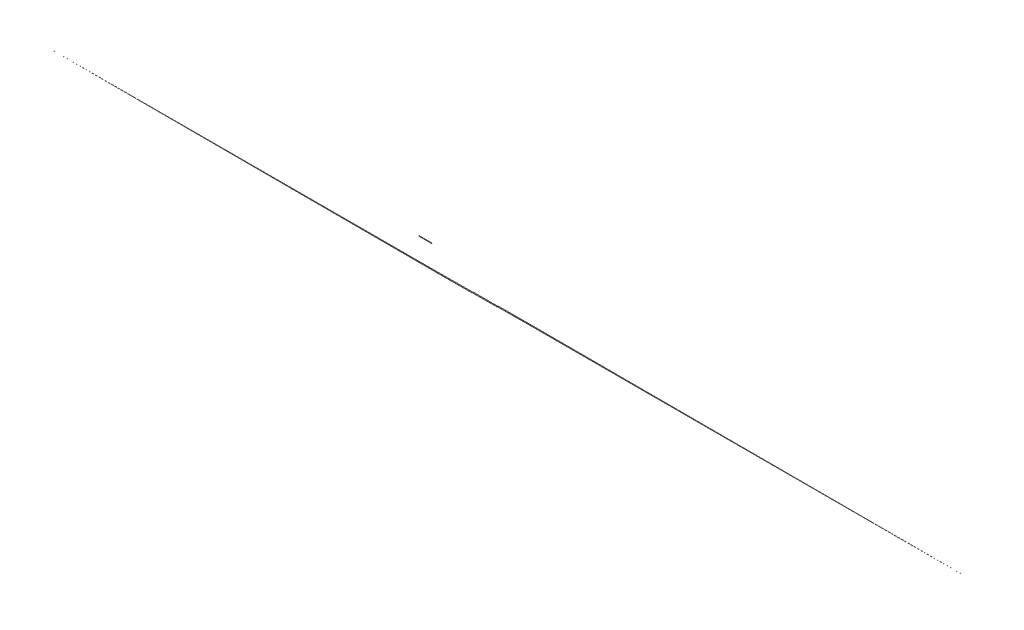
ISO-10303-21;
HEADER;
FILE_DESCRIPTION(('STEP AP214'),'2;1');
FILE_NAME('part.step','',(''),(''),'','','');
FILE_SCHEMA(('AUTOMOTIVE_DESIGN { 1 0 10303 214 1 1 1 1 }'));
ENDSEC;
DATA;
#1=APPLICATION_CONTEXT('core data for automotive mechanical design processes');
#2=APPLICATION_PROTOCOL_DEFINITION('international standard','automotive_design',2000,#1);
#3=PRODUCT_CONTEXT('',#1,'mechanical');
#4=PRODUCT('Part','Part','',(#3));
#5=PRODUCT_RELATED_PRODUCT_CATEGORY('part','',(#4));
#6=PRODUCT_DEFINITION_FORMATION('','',#4);
#7=PRODUCT_DEFINITION_CONTEXT('part definition',#1,'design');
#8=PRODUCT_DEFINITION('design','',#6,#7);
#9=PRODUCT_DEFINITION_SHAPE('','',#8);
#10=(LENGTH_UNIT() NAMED_UNIT(*) SI_UNIT(.MILLI.,.METRE.));
#11=(NAMED_UNIT(*) PLANE_ANGLE_UNIT() SI_UNIT($,.RADIAN.));
#12=(NAMED_UNIT(*) SI_UNIT($,.STERADIAN.) SOLID_ANGLE_UNIT());
#13=UNCERTAINTY_MEASURE_WITH_UNIT(LENGTH_MEASURE(1.E-05),#10,'distance_accuracy_value','');
#14=(GEOMETRIC_REPRESENTATION_CONTEXT(3) GLOBAL_UNCERTAINTY_ASSIGNED_CONTEXT((#13)) GLOBAL_UNIT_ASSIGNED_CONTEXT((#10,
#11,#12)) REPRESENTATION_CONTEXT('',''));
#15=CARTESIAN_POINT('',(0.,0.,0.));
#16=DIRECTION('',(0.,0.,1.));
#17=DIRECTION('',(1.,0.,0.));
#18=AXIS2_PLACEMENT_3D('',#15,#16,#17);
#19=CARTESIAN_POINT('',(-36752.2624113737,1400.,5.));
#20=DIRECTION('',(1.,0.,0.));
#21=DIRECTION('',(0.,0.,-1.));
#22=AXIS2_PLACEMENT_3D('',#19,#20,#21);
#23=PLANE('',#22);
#24=DIRECTION('',(0.,-1.,0.));
#25=VECTOR('',#24,1.);
#26=CARTESIAN_POINT('',(-36752.2624113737,1400.,-5.));
#27=LINE('',#26,#25);
#28=CARTESIAN_POINT('',(-36752.2624113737,1431.07753214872,-5.));
#29=VERTEX_POINT('',#28);
#30=CARTESIAN_POINT('',(-36752.2624113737,1400.,-5.));
#31=VERTEX_POINT('',#30);
#32=EDGE_CURVE('E110',#29,#31,#27,.T.);
#33=ORIENTED_EDGE('',*,*,#32,.T.);
#34=DIRECTION('',(0.,0.,-1.));
#35=VECTOR('',#34,1.);
#36=CARTESIAN_POINT('',(-36752.2624113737,1400.,5.));
#37=LINE('',#36,#35);
#38=CARTESIAN_POINT('',(-36752.2624113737,1400.,5.));
#39=VERTEX_POINT('',#38);
#40=EDGE_CURVE('E12',#39,#31,#37,.T.);
#41=ORIENTED_EDGE('',*,*,#40,.F.);
#42=DIRECTION('',(0.,-1.,0.));
#43=VECTOR('',#42,1.);
#44=CARTESIAN_POINT('',(-36752.2624113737,1400.,5.));
#45=LINE('',#44,#43);
#46=CARTESIAN_POINT('',(-36752.2624113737,1431.07753214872,5.));
#47=VERTEX_POINT('',#46);
#48=EDGE_CURVE('E98',#47,#39,#45,.T.);
#49=ORIENTED_EDGE('',*,*,#48,.F.);
#50=DIRECTION('',(0.,0.,-1.));
#51=VECTOR('',#50,1.);
#52=CARTESIAN_POINT('',(-36752.2624113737,1431.07753214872,5.));
#53=LINE('',#52,#51);
#54=EDGE_CURVE('E106',#47,#29,#53,.T.);
#55=ORIENTED_EDGE('',*,*,#54,.T.);
#56=EDGE_LOOP('',(#33,#41,#49,#55));
#57=FACE_BOUND('',#56,.T.);
#58=ADVANCED_FACE('F47',(#57),#23,.F.);
#59=CARTESIAN_POINT('',(-36752.2624113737,1400.,5.));
#60=DIRECTION('',(0.,1.,0.));
#61=DIRECTION('',(0.,0.,1.));
#62=AXIS2_PLACEMENT_3D('',#59,#60,#61);
#63=PLANE('',#62);
#64=DIRECTION('',(1.,0.,0.));
#65=VECTOR('',#64,1.);
#66=CARTESIAN_POINT('',(-36752.2624113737,1400.,-5.));
#67=LINE('',#66,#65);
#68=CARTESIAN_POINT('',(-35897.7132387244,1400.,-5.));
#69=VERTEX_POINT('',#68);
#70=EDGE_CURVE('E102',#31,#69,#67,.T.);
#71=ORIENTED_EDGE('',*,*,#70,.T.);
#72=DIRECTION('',(0.,0.,-1.));
#73=VECTOR('',#72,1.);
#74=CARTESIAN_POINT('',(-35897.7132387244,1400.,5.));
#75=LINE('',#74,#73);
#76=CARTESIAN_POINT('',(-35897.7132387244,1400.,5.));
#77=VERTEX_POINT('',#76);
#78=EDGE_CURVE('E55',#77,#69,#75,.T.);
#79=ORIENTED_EDGE('',*,*,#78,.F.);
#80=DIRECTION('',(1.,0.,0.));
#81=VECTOR('',#80,1.);
#82=CARTESIAN_POINT('',(-36752.2624113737,1400.,5.));
#83=LINE('',#82,#81);
#84=EDGE_CURVE('E93',#39,#77,#83,.T.);
#85=ORIENTED_EDGE('',*,*,#84,.F.);
#86=ORIENTED_EDGE('',*,*,#40,.T.);
#87=EDGE_LOOP('',(#71,#79,#85,#86));
#88=FACE_BOUND('',#87,.T.);
#89=ADVANCED_FACE('F101',(#88),#63,.F.);
#90=CARTESIAN_POINT('',(-35897.7132387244,1400.,5.));
#91=DIRECTION('',(-1.,0.,0.));
#92=DIRECTION('',(0.,0.,1.));
#93=AXIS2_PLACEMENT_3D('',#90,#91,#92);
#94=PLANE('',#93);
#95=DIRECTION('',(0.,1.,0.));
#96=VECTOR('',#95,1.);
#97=CARTESIAN_POINT('',(-35897.7132387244,1400.,-5.));
#98=LINE('',#97,#96);
#99=CARTESIAN_POINT('',(-35897.7132387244,1431.07753214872,-5.));
#100=VERTEX_POINT('',#99);
#101=EDGE_CURVE('E80',#69,#100,#98,.T.);
#102=ORIENTED_EDGE('',*,*,#101,.T.);
#103=DIRECTION('',(0.,0.,-1.));
#104=VECTOR('',#103,1.);
#105=CARTESIAN_POINT('',(-35897.7132387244,1431.07753214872,5.));
#106=LINE('',#105,#104);
#107=CARTESIAN_POINT('',(-35897.7132387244,1431.07753214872,5.));
#108=VERTEX_POINT('',#107);
#109=EDGE_CURVE('E103',#108,#100,#106,.T.);
#110=ORIENTED_EDGE('',*,*,#109,.F.);
#111=DIRECTION('',(0.,1.,0.));
#112=VECTOR('',#111,1.);
#113=CARTESIAN_POINT('',(-35897.7132387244,1400.,5.));
#114=LINE('',#113,#112);
#115=EDGE_CURVE('E96',#77,#108,#114,.T.);
#116=ORIENTED_EDGE('',*,*,#115,.F.);
#117=ORIENTED_EDGE('',*,*,#78,.T.);
#118=EDGE_LOOP('',(#102,#110,#116,#117));
#119=FACE_BOUND('',#118,.T.);
#120=ADVANCED_FACE('F104',(#119),#94,.F.);
#121=CARTESIAN_POINT('',(-36752.2624113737,1431.07753214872,5.));
#122=DIRECTION('',(0.,-1.,0.));
#123=DIRECTION('',(0.,0.,-1.));
#124=AXIS2_PLACEMENT_3D('',#121,#122,#123);
#125=PLANE('',#124);
#126=DIRECTION('',(-1.,0.,0.));
#127=VECTOR('',#126,1.);
#128=CARTESIAN_POINT('',(-36752.2624113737,1431.07753214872,-5.));
#129=LINE('',#128,#127);
#130=EDGE_CURVE('E86',#100,#29,#129,.T.);
#131=ORIENTED_EDGE('',*,*,#130,.T.);
#132=ORIENTED_EDGE('',*,*,#54,.F.);
#133=DIRECTION('',(-1.,0.,0.));
#134=VECTOR('',#133,1.);
#135=CARTESIAN_POINT('',(-36752.2624113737,1431.07753214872,5.));
#136=LINE('',#135,#134);
#137=EDGE_CURVE('E63',#108,#47,#136,.T.);
#138=ORIENTED_EDGE('',*,*,#137,.F.);
#139=ORIENTED_EDGE('',*,*,#109,.T.);
#140=EDGE_LOOP('',(#131,#132,#138,#139));
#141=FACE_BOUND('',#140,.T.);
#142=ADVANCED_FACE('F117',(#141),#125,.F.);
#143=CARTESIAN_POINT('',(0.,0.,5.));
#144=DIRECTION('',(0.,0.,-1.));
#145=DIRECTION('',(-1.,0.,0.));
#146=AXIS2_PLACEMENT_3D('',#143,#144,#145);
#147=PLANE('',#146);
#148=ORIENTED_EDGE('',*,*,#48,.T.);
#149=ORIENTED_EDGE('',*,*,#84,.T.);
#150=ORIENTED_EDGE('',*,*,#115,.T.);
#151=ORIENTED_EDGE('',*,*,#137,.T.);
#152=EDGE_LOOP('',(#148,#149,#150,#151));
#153=FACE_BOUND('',#152,.T.);
#154=ADVANCED_FACE('F94',(#153),#147,.F.);
#155=CARTESIAN_POINT('',(0.,0.,-5.));
#156=DIRECTION('',(0.,0.,-1.));
#157=DIRECTION('',(-1.,0.,0.));
#158=AXIS2_PLACEMENT_3D('',#155,#156,#157);
#159=PLANE('',#158);
#160=ORIENTED_EDGE('',*,*,#32,.F.);
#161=ORIENTED_EDGE('',*,*,#130,.F.);
#162=ORIENTED_EDGE('',*,*,#101,.F.);
#163=ORIENTED_EDGE('',*,*,#70,.F.);
#164=EDGE_LOOP('',(#160,#161,#162,#163));
#165=FACE_BOUND('',#164,.T.);
#166=ADVANCED_FACE('F120',(#165),#159,.T.);
#167=CLOSED_SHELL('',(#58,#89,#120,#142,#154,#166));
#168=MANIFOLD_SOLID_BREP('B2_NOT_SHOWN',#167);
#169=CARTESIAN_POINT('',(-35632.,-64.8812567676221,75.));
#170=DIRECTION('',(-0.00414161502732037,0.999991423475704,0.));
#171=DIRECTION('',(-0.999991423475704,-0.00414161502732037,0.));
#172=AXIS2_PLACEMENT_3D('',#169,#170,#171);
#173=PLANE('',#172);
#174=DIRECTION('',(0.999990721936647,0.00414161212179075,0.00118452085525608));
#175=VECTOR('',#174,1.);
#176=CARTESIAN_POINT('',(-35631.9471243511,-64.8810377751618,30.3607983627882));
#177=LINE('',#176,#175);
#178=CARTESIAN_POINT('',(-35632.,-64.8812567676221,30.3607357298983));
#179=VERTEX_POINT('',#178);
#180=CARTESIAN_POINT('',(-33229.,-54.9288705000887,33.2071657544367));
#181=VERTEX_POINT('',#180);
#182=EDGE_CURVE('E239',#179,#181,#177,.T.);
#183=ORIENTED_EDGE('',*,*,#182,.F.);
#184=DIRECTION('',(0.,0.,-1.));
#185=VECTOR('',#184,1.);
#186=CARTESIAN_POINT('',(-35632.,-64.8812567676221,75.));
#187=LINE('',#186,#185);
#188=CARTESIAN_POINT('',(-35632.,-64.8812567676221,-30.3607357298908));
#189=VERTEX_POINT('',#188);
#190=EDGE_CURVE('E236',#179,#189,#187,.T.);
#191=ORIENTED_EDGE('',*,*,#190,.T.);
#192=DIRECTION('',(-0.999990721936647,-0.00414161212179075,0.00118452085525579));
#193=VECTOR('',#192,1.);
#194=CARTESIAN_POINT('',(-35632.1248008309,-64.8817736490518,-30.3605878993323));
#195=LINE('',#194,#193);
#196=CARTESIAN_POINT('',(-33229.,-54.9288705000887,-33.2071657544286));
#197=VERTEX_POINT('',#196);
#198=EDGE_CURVE('E202',#197,#189,#195,.T.);
#199=ORIENTED_EDGE('',*,*,#198,.F.);
#200=DIRECTION('',(0.,0.,-1.));
#201=VECTOR('',#200,1.);
#202=CARTESIAN_POINT('',(-33229.,-54.9288705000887,75.));
#203=LINE('',#202,#201);
#204=EDGE_CURVE('E225',#181,#197,#203,.T.);
#205=ORIENTED_EDGE('',*,*,#204,.F.);
#206=EDGE_LOOP('',(#183,#191,#199,#205));
#207=FACE_BOUND('',#206,.T.);
#208=ADVANCED_FACE('F181',(#207),#173,.F.);
#209=CARTESIAN_POINT('',(-33229.,-54.9288705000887,75.));
#210=DIRECTION('',(-0.99999092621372,-0.00425998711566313,0.));
#211=DIRECTION('',(0.00425998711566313,-0.99999092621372,0.));
#212=AXIS2_PLACEMENT_3D('',#209,#210,#211);
#213=PLANE('',#212);
#214=DIRECTION('',(-0.00425998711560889,0.999990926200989,-5.04609039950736E-06));
#215=VECTOR('',#214,1.);
#216=CARTESIAN_POINT('',(-33228.9999991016,-54.9290813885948,33.2071657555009));
#217=LINE('',#216,#215);
#218=CARTESIAN_POINT('',(-33229.0282735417,-48.2919290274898,33.2071322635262));
#219=VERTEX_POINT('',#218);
#220=EDGE_CURVE('E248',#181,#219,#217,.T.);
#221=ORIENTED_EDGE('',*,*,#220,.F.);
#222=ORIENTED_EDGE('',*,*,#204,.T.);
#223=DIRECTION('',(0.00425998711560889,-0.999990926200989,-5.04609039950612E-06));
#224=VECTOR('',#223,1.);
#225=CARTESIAN_POINT('',(-33229.0000023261,-54.9283244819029,-33.2071657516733));
#226=LINE('',#225,#224);
#227=CARTESIAN_POINT('',(-33229.0282735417,-48.2919290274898,-33.207132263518));
#228=VERTEX_POINT('',#227);
#229=EDGE_CURVE('E233',#228,#197,#226,.T.);
#230=ORIENTED_EDGE('',*,*,#229,.F.);
#231=DIRECTION('',(0.,0.,-1.));
#232=VECTOR('',#231,1.);
#233=CARTESIAN_POINT('',(-33229.0282735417,-48.2919290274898,75.));
#234=LINE('',#233,#232);
#235=EDGE_CURVE('E232',#219,#228,#234,.T.);
#236=ORIENTED_EDGE('',*,*,#235,.F.);
#237=EDGE_LOOP('',(#221,#222,#230,#236));
#238=FACE_BOUND('',#237,.T.);
#239=ADVANCED_FACE('F247',(#238),#213,.F.);
#240=CARTESIAN_POINT('',(-33229.0282735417,-48.2919290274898,75.));
#241=DIRECTION('',(0.00437835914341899,-0.999990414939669,0.));
#242=DIRECTION('',(0.999990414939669,0.00437835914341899,0.));
#243=AXIS2_PLACEMENT_3D('',#240,#241,#242);
#244=PLANE('',#243);
#245=DIRECTION('',(-0.999989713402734,-0.00437835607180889,-0.00118451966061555));
#246=VECTOR('',#245,1.);
#247=CARTESIAN_POINT('',(-33228.9787695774,-48.2917122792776,33.2071909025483));
#248=LINE('',#247,#246);
#249=CARTESIAN_POINT('',(-35632.0258500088,-58.8132162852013,30.3607051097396));
#250=VERTEX_POINT('',#249);
#251=EDGE_CURVE('E194',#219,#250,#248,.T.);
#252=ORIENTED_EDGE('',*,*,#251,.F.);
#253=ORIENTED_EDGE('',*,*,#235,.T.);
#254=DIRECTION('',(0.999989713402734,0.00437835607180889,-0.00118451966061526));
#255=VECTOR('',#254,1.);
#256=CARTESIAN_POINT('',(-33229.1564456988,-48.2924902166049,-33.2069804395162));
#257=LINE('',#256,#255);
#258=CARTESIAN_POINT('',(-35632.0258500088,-58.8132162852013,-30.3607051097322));
#259=VERTEX_POINT('',#258);
#260=EDGE_CURVE('E219',#259,#228,#257,.T.);
#261=ORIENTED_EDGE('',*,*,#260,.F.);
#262=DIRECTION('',(0.,0.,-1.));
#263=VECTOR('',#262,1.);
#264=CARTESIAN_POINT('',(-35632.0258500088,-58.8132162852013,75.));
#265=LINE('',#264,#263);
#266=EDGE_CURVE('E230',#250,#259,#265,.T.);
#267=ORIENTED_EDGE('',*,*,#266,.F.);
#268=EDGE_LOOP('',(#252,#253,#261,#267));
#269=FACE_BOUND('',#268,.T.);
#270=ADVANCED_FACE('F229',(#269),#244,.F.);
#271=CARTESIAN_POINT('',(-35632.0258500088,-58.8132162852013,75.));
#272=DIRECTION('',(0.999990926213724,0.00425998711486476,0.));
#273=DIRECTION('',(-0.00425998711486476,0.999990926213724,0.));
#274=AXIS2_PLACEMENT_3D('',#271,#272,#273);
#275=PLANE('',#274);
#276=DIRECTION('',(0.00425998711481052,-0.999990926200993,5.04609039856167E-06));
#277=VECTOR('',#276,1.);
#278=CARTESIAN_POINT('',(-35632.0258490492,-58.8134415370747,30.3607051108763));
#279=LINE('',#278,#277);
#280=EDGE_CURVE('E45',#250,#179,#279,.T.);
#281=ORIENTED_EDGE('',*,*,#280,.F.);
#282=ORIENTED_EDGE('',*,*,#266,.T.);
#283=DIRECTION('',(-0.00425998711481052,0.999990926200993,5.04609039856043E-06));
#284=VECTOR('',#283,1.);
#285=CARTESIAN_POINT('',(-35632.0258522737,-58.812684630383,-30.3607051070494));
#286=LINE('',#285,#284);
#287=EDGE_CURVE('E188',#189,#259,#286,.T.);
#288=ORIENTED_EDGE('',*,*,#287,.F.);
#289=ORIENTED_EDGE('',*,*,#190,.F.);
#290=EDGE_LOOP('',(#281,#282,#288,#289));
#291=FACE_BOUND('',#290,.T.);
#292=ADVANCED_FACE('F235',(#291),#275,.F.);
#293=CARTESIAN_POINT('',(-33219.,-64.8897492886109,-33.2190110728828));
#294=DIRECTION('',(-0.00118453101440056,0.,-0.999999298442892));
#295=DIRECTION('',(-0.999999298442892,0.,0.00118453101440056));
#296=AXIS2_PLACEMENT_3D('',#293,#294,#295);
#297=PLANE('',#296);
#298=ORIENTED_EDGE('',*,*,#198,.T.);
#299=ORIENTED_EDGE('',*,*,#287,.T.);
#300=ORIENTED_EDGE('',*,*,#260,.T.);
#301=ORIENTED_EDGE('',*,*,#229,.T.);
#302=EDGE_LOOP('',(#298,#299,#300,#301));
#303=FACE_BOUND('',#302,.T.);
#304=ADVANCED_FACE('F218',(#303),#297,.T.);
#305=CARTESIAN_POINT('',(-61263.,-64.8897492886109,0.));
#306=DIRECTION('',(-0.00118453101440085,0.,0.999999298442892));
#307=DIRECTION('',(0.999999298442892,0.,0.00118453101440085));
#308=AXIS2_PLACEMENT_3D('',#305,#306,#307);
#309=PLANE('',#308);
#310=ORIENTED_EDGE('',*,*,#182,.T.);
#311=ORIENTED_EDGE('',*,*,#220,.T.);
#312=ORIENTED_EDGE('',*,*,#251,.T.);
#313=ORIENTED_EDGE('',*,*,#280,.T.);
#314=EDGE_LOOP('',(#310,#311,#312,#313));
#315=FACE_BOUND('',#314,.T.);
#316=ADVANCED_FACE('F255',(#315),#309,.T.);
#317=CLOSED_SHELL('',(#208,#239,#270,#292,#304,#316));
#318=MANIFOLD_SOLID_BREP('B6',#317);
#319=CARTESIAN_POINT('',(-33209.,-33.2064719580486,75.));
#320=DIRECTION('',(0.99999092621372,0.00425998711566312,0.));
#321=DIRECTION('',(-0.00425998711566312,0.999990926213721,0.));
#322=AXIS2_PLACEMENT_3D('',#319,#320,#321);
#323=PLANE('',#322);
#324=DIRECTION('',(0.00425998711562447,-0.999990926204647,-4.25998853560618E-06));
#325=VECTOR('',#324,1.);
#326=CARTESIAN_POINT('',(-33209.0000007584,-33.2062939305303,33.209011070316));
#327=LINE('',#326,#325);
#328=CARTESIAN_POINT('',(-33209.,-33.2064719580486,33.2090110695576));
#329=VERTEX_POINT('',#328);
#330=CARTESIAN_POINT('',(-33208.9717264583,-39.8434134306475,33.2089827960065));
#331=VERTEX_POINT('',#330);
#332=EDGE_CURVE('E373',#329,#331,#327,.T.);
#333=ORIENTED_EDGE('',*,*,#332,.F.);
#334=DIRECTION('',(0.,0.,-1.));
#335=VECTOR('',#334,1.);
#336=CARTESIAN_POINT('',(-33209.,-33.2064719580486,75.));
#337=LINE('',#336,#335);
#338=CARTESIAN_POINT('',(-33209.,-33.2064719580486,-33.2090110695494));
#339=VERTEX_POINT('',#338);
#340=EDGE_CURVE('E370',#329,#339,#337,.T.);
#341=ORIENTED_EDGE('',*,*,#340,.T.);
#342=DIRECTION('',(-0.00425998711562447,0.999990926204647,-4.25998853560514E-06));
#343=VECTOR('',#342,1.);
#344=CARTESIAN_POINT('',(-33208.9999980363,-33.2069329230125,-33.2090110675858));
#345=LINE('',#344,#343);
#346=CARTESIAN_POINT('',(-33208.9717264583,-39.8434134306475,-33.2089827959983));
#347=VERTEX_POINT('',#346);
#348=EDGE_CURVE('E336',#347,#339,#345,.T.);
#349=ORIENTED_EDGE('',*,*,#348,.F.);
#350=DIRECTION('',(0.,0.,-1.));
#351=VECTOR('',#350,1.);
#352=CARTESIAN_POINT('',(-33208.9717264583,-39.8434134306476,75.));
#353=LINE('',#352,#351);
#354=EDGE_CURVE('E359',#331,#347,#353,.T.);
#355=ORIENTED_EDGE('',*,*,#354,.F.);
#356=EDGE_LOOP('',(#333,#341,#349,#355));
#357=FACE_BOUND('',#356,.T.);
#358=ADVANCED_FACE('F315',(#357),#323,.F.);
#359=CARTESIAN_POINT('',(-33208.9717264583,-39.8434134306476,75.));
#360=DIRECTION('',(-0.00435998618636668,0.999990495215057,0.));
#361=DIRECTION('',(-0.999990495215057,-0.00435998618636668,0.));
#362=AXIS2_PLACEMENT_3D('',#359,#360,#361);
#363=PLANE('',#362);
#364=DIRECTION('',(0.999989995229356,0.00435998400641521,-0.00099999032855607));
#365=VECTOR('',#364,1.);
#366=CARTESIAN_POINT('',(-33209.0135166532,-39.843595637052,33.2090245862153));
#367=LINE('',#366,#365);
#368=CARTESIAN_POINT('',(-31587.,-32.7715718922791,31.5870105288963));
#369=VERTEX_POINT('',#368);
#370=EDGE_CURVE('E382',#331,#369,#367,.T.);
#371=ORIENTED_EDGE('',*,*,#370,.F.);
#372=ORIENTED_EDGE('',*,*,#354,.T.);
#373=DIRECTION('',(-0.999989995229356,-0.00435998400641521,-0.000999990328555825));
#374=VECTOR('',#373,1.);
#375=CARTESIAN_POINT('',(-33208.8635196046,-39.8429416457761,-33.2088745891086));
#376=LINE('',#375,#374);
#377=CARTESIAN_POINT('',(-31587.,-32.7715718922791,-31.5870105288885));
#378=VERTEX_POINT('',#377);
#379=EDGE_CURVE('E367',#378,#347,#376,.T.);
#380=ORIENTED_EDGE('',*,*,#379,.F.);
#381=DIRECTION('',(0.,0.,-1.));
#382=VECTOR('',#381,1.);
#383=CARTESIAN_POINT('',(-31587.,-32.7715718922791,75.));
#384=LINE('',#383,#382);
#385=EDGE_CURVE('E366',#369,#378,#384,.T.);
#386=ORIENTED_EDGE('',*,*,#385,.F.);
#387=EDGE_LOOP('',(#371,#372,#380,#386));
#388=FACE_BOUND('',#387,.T.);
#389=ADVANCED_FACE('F381',(#388),#363,.F.);
#390=CARTESIAN_POINT('',(-31587.,-32.7715718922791,75.));
#391=DIRECTION('',(-0.999990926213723,-0.00425998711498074,0.));
#392=DIRECTION('',(0.00425998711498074,-0.999990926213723,0.));
#393=AXIS2_PLACEMENT_3D('',#390,#391,#392);
#394=PLANE('',#393);
#395=DIRECTION('',(-0.00425998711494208,0.99999092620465,4.2599885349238E-06));
#396=VECTOR('',#395,1.);
#397=CARTESIAN_POINT('',(-31587.0000007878,-32.7713869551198,31.5870105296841));
#398=LINE('',#397,#396);
#399=CARTESIAN_POINT('',(-31587.0268916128,-26.4590249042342,31.5870374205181));
#400=VERTEX_POINT('',#399);
#401=EDGE_CURVE('E328',#369,#400,#398,.T.);
#402=ORIENTED_EDGE('',*,*,#401,.F.);
#403=ORIENTED_EDGE('',*,*,#385,.T.);
#404=DIRECTION('',(0.00425998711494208,-0.99999092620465,4.25998853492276E-06));
#405=VECTOR('',#404,1.);
#406=CARTESIAN_POINT('',(-31586.9999980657,-32.7720259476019,-31.5870105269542));
#407=LINE('',#406,#405);
#408=CARTESIAN_POINT('',(-31587.0268916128,-26.4590249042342,-31.5870374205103));
#409=VERTEX_POINT('',#408);
#410=EDGE_CURVE('E353',#409,#378,#407,.T.);
#411=ORIENTED_EDGE('',*,*,#410,.F.);
#412=DIRECTION('',(0.,0.,-1.));
#413=VECTOR('',#412,1.);
#414=CARTESIAN_POINT('',(-31587.0268916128,-26.4590249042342,75.));
#415=LINE('',#414,#413);
#416=EDGE_CURVE('E364',#400,#409,#415,.T.);
#417=ORIENTED_EDGE('',*,*,#416,.F.);
#418=EDGE_LOOP('',(#402,#403,#411,#417));
#419=FACE_BOUND('',#418,.T.);
#420=ADVANCED_FACE('F363',(#419),#394,.F.);
#421=CARTESIAN_POINT('',(-31587.0268916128,-26.4590249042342,75.));
#422=DIRECTION('',(0.00415998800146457,-0.999991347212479,0.));
#423=DIRECTION('',(0.999991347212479,0.00415998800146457,0.));
#424=AXIS2_PLACEMENT_3D('',#421,#422,#423);
#425=PLANE('',#424);
#426=DIRECTION('',(-0.999990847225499,-0.00415998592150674,0.000999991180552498));
#427=VECTOR('',#426,1.);
#428=CARTESIAN_POINT('',(-31587.0703037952,-26.4592054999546,31.5870808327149));
#429=LINE('',#428,#427);
#430=EDGE_CURVE('E179',#400,#329,#429,.T.);
#431=ORIENTED_EDGE('',*,*,#430,.F.);
#432=ORIENTED_EDGE('',*,*,#416,.T.);
#433=DIRECTION('',(0.999990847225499,0.00415998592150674,0.000999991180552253));
#434=VECTOR('',#433,1.);
#435=CARTESIAN_POINT('',(-31586.920306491,-26.4585815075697,-31.586930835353));
#436=LINE('',#435,#434);
#437=EDGE_CURVE('E322',#339,#409,#436,.T.);
#438=ORIENTED_EDGE('',*,*,#437,.F.);
#439=ORIENTED_EDGE('',*,*,#340,.F.);
#440=EDGE_LOOP('',(#431,#432,#438,#439));
#441=FACE_BOUND('',#440,.T.);
#442=ADVANCED_FACE('F369',(#441),#425,.F.);
#443=CARTESIAN_POINT('',(0.,-64.8897492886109,0.));
#444=DIRECTION('',(0.000999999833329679,0.,-0.999999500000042));
#445=DIRECTION('',(-0.999999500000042,0.,-0.000999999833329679));
#446=AXIS2_PLACEMENT_3D('',#443,#444,#445);
#447=PLANE('',#446);
#448=ORIENTED_EDGE('',*,*,#348,.T.);
#449=ORIENTED_EDGE('',*,*,#437,.T.);
#450=ORIENTED_EDGE('',*,*,#410,.T.);
#451=ORIENTED_EDGE('',*,*,#379,.T.);
#452=EDGE_LOOP('',(#448,#449,#450,#451));
#453=FACE_BOUND('',#452,.T.);
#454=ADVANCED_FACE('F352',(#453),#447,.T.);
#455=CARTESIAN_POINT('',(-33219.,-64.8897492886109,33.2190110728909));
#456=DIRECTION('',(0.000999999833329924,0.,0.999999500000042));
#457=DIRECTION('',(0.999999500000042,0.,-0.000999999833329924));
#458=AXIS2_PLACEMENT_3D('',#455,#456,#457);
#459=PLANE('',#458);
#460=ORIENTED_EDGE('',*,*,#332,.T.);
#461=ORIENTED_EDGE('',*,*,#370,.T.);
#462=ORIENTED_EDGE('',*,*,#401,.T.);
#463=ORIENTED_EDGE('',*,*,#430,.T.);
#464=EDGE_LOOP('',(#460,#461,#462,#463));
#465=FACE_BOUND('',#464,.T.);
#466=ADVANCED_FACE('F389',(#465),#459,.T.);
#467=CLOSED_SHELL('',(#358,#389,#420,#442,#454,#466));
#468=MANIFOLD_SOLID_BREP('B39',#467);
#469=CARTESIAN_POINT('',(-29332.0249873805,2.92420012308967,75.));
#470=DIRECTION('',(0.00415998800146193,-0.999991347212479,0.));
#471=DIRECTION('',(0.999991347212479,0.00415998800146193,0.));
#472=AXIS2_PLACEMENT_3D('',#469,#470,#471);
#473=PLANE('',#472);
#474=DIRECTION('',(-0.999990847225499,-0.0041599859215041,0.000999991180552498));
#475=VECTOR('',#474,1.);
#476=CARTESIAN_POINT('',(-29332.070654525,2.92401014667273,29.3320804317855));
#477=LINE('',#476,#475);
#478=CARTESIAN_POINT('',(-29332.0249873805,2.92420012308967,29.3320347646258));
#479=VERTEX_POINT('',#478);
#480=CARTESIAN_POINT('',(-31567.0268916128,-6.37346143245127,31.5670374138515));
#481=VERTEX_POINT('',#480);
#482=EDGE_CURVE('E507',#479,#481,#477,.T.);
#483=ORIENTED_EDGE('',*,*,#482,.F.);
#484=DIRECTION('',(0.,0.,-1.));
#485=VECTOR('',#484,1.);
#486=CARTESIAN_POINT('',(-29332.0249873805,2.92420012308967,75.));
#487=LINE('',#486,#485);
#488=CARTESIAN_POINT('',(-29332.0249873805,2.92420012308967,-29.3320347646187));
#489=VERTEX_POINT('',#488);
#490=EDGE_CURVE('E504',#479,#489,#487,.T.);
#491=ORIENTED_EDGE('',*,*,#490,.T.);
#492=DIRECTION('',(0.999990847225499,0.0041599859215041,0.000999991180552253));
#493=VECTOR('',#492,1.);
#494=CARTESIAN_POINT('',(-29331.9206572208,2.92463413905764,-29.3319304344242));
#495=LINE('',#494,#493);
#496=CARTESIAN_POINT('',(-31567.0268916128,-6.37346143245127,-31.5670374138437));
#497=VERTEX_POINT('',#496);
#498=EDGE_CURVE('E470',#497,#489,#495,.T.);
#499=ORIENTED_EDGE('',*,*,#498,.F.);
#500=DIRECTION('',(0.,0.,-1.));
#501=VECTOR('',#500,1.);
#502=CARTESIAN_POINT('',(-31567.0268916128,-6.37346143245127,75.));
#503=LINE('',#502,#501);
#504=EDGE_CURVE('E493',#481,#497,#503,.T.);
#505=ORIENTED_EDGE('',*,*,#504,.F.);
#506=EDGE_LOOP('',(#483,#491,#499,#505));
#507=FACE_BOUND('',#506,.T.);
#508=ADVANCED_FACE('F449',(#507),#473,.F.);
#509=CARTESIAN_POINT('',(-31567.0268916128,-6.37346143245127,75.));
#510=DIRECTION('',(0.999990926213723,0.00425998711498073,0.));
#511=DIRECTION('',(-0.00425998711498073,0.999990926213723,0.));
#512=AXIS2_PLACEMENT_3D('',#509,#510,#511);
#513=PLANE('',#512);
#514=DIRECTION('',(0.00425998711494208,-0.99999092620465,-4.25998853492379E-06));
#515=VECTOR('',#514,1.);
#516=CARTESIAN_POINT('',(-31567.026892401,-6.37327641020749,31.5670374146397));
#517=LINE('',#516,#515);
#518=CARTESIAN_POINT('',(-31567.,-12.6860084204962,31.5670105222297));
#519=VERTEX_POINT('',#518);
#520=EDGE_CURVE('E516',#481,#519,#517,.T.);
#521=ORIENTED_EDGE('',*,*,#520,.F.);
#522=ORIENTED_EDGE('',*,*,#504,.T.);
#523=DIRECTION('',(-0.00425998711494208,0.99999092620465,-4.25998853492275E-06));
#524=VECTOR('',#523,1.);
#525=CARTESIAN_POINT('',(-31567.0268896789,-6.37391540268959,-31.5670374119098));
#526=LINE('',#525,#524);
#527=CARTESIAN_POINT('',(-31567.,-12.6860084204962,-31.5670105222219));
#528=VERTEX_POINT('',#527);
#529=EDGE_CURVE('E501',#528,#497,#526,.T.);
#530=ORIENTED_EDGE('',*,*,#529,.F.);
#531=DIRECTION('',(0.,0.,-1.));
#532=VECTOR('',#531,1.);
#533=CARTESIAN_POINT('',(-31567.,-12.6860084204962,75.));
#534=LINE('',#533,#532);
#535=EDGE_CURVE('E500',#519,#528,#534,.T.);
#536=ORIENTED_EDGE('',*,*,#535,.F.);
#537=EDGE_LOOP('',(#521,#522,#530,#536));
#538=FACE_BOUND('',#537,.T.);
#539=ADVANCED_FACE('F515',(#538),#513,.F.);
#540=CARTESIAN_POINT('',(-31567.,-12.6860084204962,75.));
#541=DIRECTION('',(-0.00435998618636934,0.999990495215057,0.));
#542=DIRECTION('',(-0.999990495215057,-0.00435998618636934,0.));
#543=AXIS2_PLACEMENT_3D('',#540,#541,#542);
#544=PLANE('',#543);
#545=DIRECTION('',(0.999989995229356,0.00435998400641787,-0.00099999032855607));
#546=VECTOR('',#545,1.);
#547=CARTESIAN_POINT('',(-31567.0434321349,-12.6861977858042,31.567053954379));
#548=LINE('',#547,#546);
#549=CARTESIAN_POINT('',(-29332.,-2.94134667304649,29.332009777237));
#550=VERTEX_POINT('',#549);
#551=EDGE_CURVE('E462',#519,#550,#548,.T.);
#552=ORIENTED_EDGE('',*,*,#551,.F.);
#553=ORIENTED_EDGE('',*,*,#535,.T.);
#554=DIRECTION('',(-0.999989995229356,-0.00435998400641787,-0.000999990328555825));
#555=VECTOR('',#554,1.);
#556=CARTESIAN_POINT('',(-31566.8934350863,-12.6855437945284,-31.5669039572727));
#557=LINE('',#556,#555);
#558=CARTESIAN_POINT('',(-29332.,-2.94134667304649,-29.3320097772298));
#559=VERTEX_POINT('',#558);
#560=EDGE_CURVE('E487',#559,#528,#557,.T.);
#561=ORIENTED_EDGE('',*,*,#560,.F.);
#562=DIRECTION('',(0.,0.,-1.));
#563=VECTOR('',#562,1.);
#564=CARTESIAN_POINT('',(-29332.,-2.94134667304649,75.));
#565=LINE('',#564,#563);
#566=EDGE_CURVE('E498',#550,#559,#565,.T.);
#567=ORIENTED_EDGE('',*,*,#566,.F.);
#568=EDGE_LOOP('',(#552,#553,#561,#567));
#569=FACE_BOUND('',#568,.T.);
#570=ADVANCED_FACE('F497',(#569),#544,.F.);
#571=CARTESIAN_POINT('',(-29332.,-2.94134667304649,75.));
#572=DIRECTION('',(-0.999990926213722,-0.00425998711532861,0.));
#573=DIRECTION('',(0.00425998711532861,-0.999990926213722,0.));
#574=AXIS2_PLACEMENT_3D('',#571,#572,#573);
#575=PLANE('',#574);
#576=DIRECTION('',(-0.00425998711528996,0.999990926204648,4.25998853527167E-06));
#577=VECTOR('',#576,1.);
#578=CARTESIAN_POINT('',(-29332.0000008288,-2.94115212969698,29.3320097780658));
#579=LINE('',#578,#577);
#580=EDGE_CURVE('E313',#550,#479,#579,.T.);
#581=ORIENTED_EDGE('',*,*,#580,.F.);
#582=ORIENTED_EDGE('',*,*,#566,.T.);
#583=DIRECTION('',(0.00425998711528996,-0.999990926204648,4.25998853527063E-06));
#584=VECTOR('',#583,1.);
#585=CARTESIAN_POINT('',(-29331.9999981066,-2.94179112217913,-29.3320097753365));
#586=LINE('',#585,#584);
#587=EDGE_CURVE('E456',#489,#559,#586,.T.);
#588=ORIENTED_EDGE('',*,*,#587,.F.);
#589=ORIENTED_EDGE('',*,*,#490,.F.);
#590=EDGE_LOOP('',(#581,#582,#588,#589));
#591=FACE_BOUND('',#590,.T.);
#592=ADVANCED_FACE('F503',(#591),#575,.F.);
#593=CARTESIAN_POINT('',(0.,-64.8897492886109,0.));
#594=DIRECTION('',(0.000999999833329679,0.,-0.999999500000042));
#595=DIRECTION('',(-0.999999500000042,0.,-0.000999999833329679));
#596=AXIS2_PLACEMENT_3D('',#593,#594,#595);
#597=PLANE('',#596);
#598=ORIENTED_EDGE('',*,*,#498,.T.);
#599=ORIENTED_EDGE('',*,*,#587,.T.);
#600=ORIENTED_EDGE('',*,*,#560,.T.);
#601=ORIENTED_EDGE('',*,*,#529,.T.);
#602=EDGE_LOOP('',(#598,#599,#600,#601));
#603=FACE_BOUND('',#602,.T.);
#604=ADVANCED_FACE('F486',(#603),#597,.T.);
#605=CARTESIAN_POINT('',(-33219.,-64.8897492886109,33.2190110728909));
#606=DIRECTION('',(0.000999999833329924,0.,0.999999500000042));
#607=DIRECTION('',(0.999999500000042,0.,-0.000999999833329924));
#608=AXIS2_PLACEMENT_3D('',#605,#606,#607);
#609=PLANE('',#608);
#610=ORIENTED_EDGE('',*,*,#482,.T.);
#611=ORIENTED_EDGE('',*,*,#520,.T.);
#612=ORIENTED_EDGE('',*,*,#551,.T.);
#613=ORIENTED_EDGE('',*,*,#580,.T.);
#614=EDGE_LOOP('',(#610,#611,#612,#613));
#615=FACE_BOUND('',#614,.T.);
#616=ADVANCED_FACE('F523',(#615),#609,.T.);
#617=CLOSED_SHELL('',(#508,#539,#570,#592,#604,#616));
#618=MANIFOLD_SOLID_BREP('B173',#617);
#619=CARTESIAN_POINT('',(-35636.,-64.8897492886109,75.));
#620=DIRECTION('',(0.000118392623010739,0.999999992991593,0.));
#621=DIRECTION('',(-0.999999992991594,0.000118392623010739,0.));
#622=AXIS2_PLACEMENT_3D('',#619,#620,#621);
#623=PLANE('',#622);
#624=DIRECTION('',(0.999999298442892,0.,0.00118453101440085));
#625=VECTOR('',#624,1.);
#626=CARTESIAN_POINT('',(-61263.,-64.8897492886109,0.));
#627=LINE('',#626,#625);
#628=CARTESIAN_POINT('',(-35636.0004543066,-64.8897492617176,30.355997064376));
#629=VERTEX_POINT('',#628);
#630=CARTESIAN_POINT('',(-35636.,-64.8897492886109,30.3559976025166));
#631=VERTEX_POINT('',#630);
#632=EDGE_CURVE('E613',#629,#631,#627,.T.);
#633=ORIENTED_EDGE('',*,*,#632,.F.);
#634=DIRECTION('',(0.9999992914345,-0.000118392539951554,0.00118453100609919));
#635=VECTOR('',#634,1.);
#636=CARTESIAN_POINT('',(-35635.9471178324,-64.8897555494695,30.3560602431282));
#637=LINE('',#636,#635);
#638=CARTESIAN_POINT('',(-61263.,-61.8557015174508,0.));
#639=VERTEX_POINT('',#638);
#640=EDGE_CURVE('E610',#639,#629,#637,.T.);
#641=ORIENTED_EDGE('',*,*,#640,.F.);
#642=DIRECTION('',(-0.9999992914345,0.000118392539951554,0.0011845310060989));
#643=VECTOR('',#642,1.);
#644=CARTESIAN_POINT('',(-35636.1247973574,-64.8897345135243,-30.3558497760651));
#645=LINE('',#644,#643);
#646=CARTESIAN_POINT('',(-35636.,-64.8897492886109,-30.3559976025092));
#647=VERTEX_POINT('',#646);
#648=EDGE_CURVE('E623',#647,#639,#645,.T.);
#649=ORIENTED_EDGE('',*,*,#648,.F.);
#650=DIRECTION('',(0.,0.,-1.));
#651=VECTOR('',#650,1.);
#652=CARTESIAN_POINT('',(-35636.,-64.8897492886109,75.));
#653=LINE('',#652,#651);
#654=EDGE_CURVE('E620',#631,#647,#653,.T.);
#655=ORIENTED_EDGE('',*,*,#654,.F.);
#656=EDGE_LOOP('',(#633,#641,#649,#655));
#657=FACE_BOUND('',#656,.T.);
#658=ADVANCED_FACE('F582',(#657),#623,.F.);
#659=CARTESIAN_POINT('',(-35636.,-58.821653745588,75.));
#660=DIRECTION('',(-1.,0.,0.));
#661=DIRECTION('',(0.,0.,1.));
#662=AXIS2_PLACEMENT_3D('',#659,#660,#661);
#663=PLANE('',#662);
#664=DIRECTION('',(0.,1.,0.));
#665=VECTOR('',#664,1.);
#666=CARTESIAN_POINT('',(-35636.,-58.821653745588,30.3559976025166));
#667=LINE('',#666,#665);
#668=CARTESIAN_POINT('',(-35636.,-58.821653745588,30.3559976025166));
#669=VERTEX_POINT('',#668);
#670=EDGE_CURVE('E599',#631,#669,#667,.T.);
#671=ORIENTED_EDGE('',*,*,#670,.F.);
#672=ORIENTED_EDGE('',*,*,#654,.T.);
#673=DIRECTION('',(0.,-1.,0.));
#674=VECTOR('',#673,1.);
#675=CARTESIAN_POINT('',(-35636.,-58.821653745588,-30.3559976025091));
#676=LINE('',#675,#674);
#677=CARTESIAN_POINT('',(-35636.,-58.821653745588,-30.3559976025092));
#678=VERTEX_POINT('',#677);
#679=EDGE_CURVE('E621',#678,#647,#676,.T.);
#680=ORIENTED_EDGE('',*,*,#679,.F.);
#681=DIRECTION('',(0.,0.,-1.));
#682=VECTOR('',#681,1.);
#683=CARTESIAN_POINT('',(-35636.,-58.821653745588,75.));
#684=LINE('',#683,#682);
#685=EDGE_CURVE('E616',#669,#678,#684,.T.);
#686=ORIENTED_EDGE('',*,*,#685,.F.);
#687=EDGE_LOOP('',(#671,#672,#680,#686));
#688=FACE_BOUND('',#687,.T.);
#689=ADVANCED_FACE('F637',(#688),#663,.F.);
#690=CARTESIAN_POINT('',(-61263.,-61.8557015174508,75.));
#691=DIRECTION('',(0.000118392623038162,-0.999999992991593,0.));
#692=DIRECTION('',(0.999999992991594,0.000118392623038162,0.));
#693=AXIS2_PLACEMENT_3D('',#690,#691,#692);
#694=PLANE('',#693);
#695=DIRECTION('',(-0.9999992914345,-0.000118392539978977,-0.00118453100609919));
#696=VECTOR('',#695,1.);
#697=CARTESIAN_POINT('',(-61262.9111602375,-61.8556909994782,0.000105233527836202));
#698=LINE('',#697,#696);
#699=EDGE_CURVE('E447',#669,#639,#698,.T.);
#700=ORIENTED_EDGE('',*,*,#699,.F.);
#701=ORIENTED_EDGE('',*,*,#685,.T.);
#702=DIRECTION('',(0.9999992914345,0.000118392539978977,-0.0011845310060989));
#703=VECTOR('',#702,1.);
#704=CARTESIAN_POINT('',(-61263.0888397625,-61.8557120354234,0.000105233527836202));
#705=LINE('',#704,#703);
#706=EDGE_CURVE('E589',#639,#678,#705,.T.);
#707=ORIENTED_EDGE('',*,*,#706,.F.);
#708=EDGE_LOOP('',(#700,#701,#707));
#709=FACE_BOUND('',#708,.T.);
#710=ADVANCED_FACE('F638',(#709),#694,.F.);
#711=CARTESIAN_POINT('',(-33219.,-64.8897492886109,-33.2190110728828));
#712=DIRECTION('',(-0.00118453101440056,0.,-0.999999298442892));
#713=DIRECTION('',(-0.999999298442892,0.,0.00118453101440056));
#714=AXIS2_PLACEMENT_3D('',#711,#712,#713);
#715=PLANE('',#714);
#716=ORIENTED_EDGE('',*,*,#648,.T.);
#717=ORIENTED_EDGE('',*,*,#706,.T.);
#718=ORIENTED_EDGE('',*,*,#679,.T.);
#719=EDGE_LOOP('',(#716,#717,#718));
#720=FACE_BOUND('',#719,.T.);
#721=ADVANCED_FACE('F633',(#720),#715,.T.);
#722=CARTESIAN_POINT('',(-61263.,-64.8897492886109,0.));
#723=DIRECTION('',(-0.00118453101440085,0.,0.999999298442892));
#724=DIRECTION('',(0.999999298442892,0.,0.00118453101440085));
#725=AXIS2_PLACEMENT_3D('',#722,#723,#724);
#726=PLANE('',#725);
#727=ORIENTED_EDGE('',*,*,#640,.T.);
#728=ORIENTED_EDGE('',*,*,#632,.T.);
#729=ORIENTED_EDGE('',*,*,#670,.T.);
#730=ORIENTED_EDGE('',*,*,#699,.T.);
#731=EDGE_LOOP('',(#727,#728,#729,#730));
#732=FACE_BOUND('',#731,.T.);
#733=ADVANCED_FACE('F612',(#732),#726,.T.);
#734=CLOSED_SHELL('',(#658,#689,#710,#721,#733));
#735=MANIFOLD_SOLID_BREP('B307',#734);
#736=CARTESIAN_POINT('',(-29328.,-2.93280000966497,75.));
#737=DIRECTION('',(-9.99999998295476E-05,0.999999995,0.));
#738=DIRECTION('',(-0.999999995,-9.99999998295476E-05,0.));
#739=AXIS2_PLACEMENT_3D('',#736,#737,#738);
#740=PLANE('',#739);
#741=DIRECTION('',(0.999999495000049,9.99999498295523E-05,-0.00099999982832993));
#742=VECTOR('',#741,1.);
#743=CARTESIAN_POINT('',(-29328.0456719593,-2.93280457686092,29.3280554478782));
#744=LINE('',#743,#742);
#745=CARTESIAN_POINT('',(-29328.,-2.93280000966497,29.3280097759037));
#746=VERTEX_POINT('',#745);
#747=CARTESIAN_POINT('',(0.,0.,0.));
#748=VERTEX_POINT('',#747);
#749=EDGE_CURVE('E732',#746,#748,#744,.T.);
#750=ORIENTED_EDGE('',*,*,#749,.F.);
#751=DIRECTION('',(0.,0.,-1.));
#752=VECTOR('',#751,1.);
#753=CARTESIAN_POINT('',(-29328.,-2.93280000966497,75.));
#754=LINE('',#753,#752);
#755=CARTESIAN_POINT('',(-29328.,-2.93280000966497,-29.3280097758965));
#756=VERTEX_POINT('',#755);
#757=EDGE_CURVE('E727',#746,#756,#754,.T.);
#758=ORIENTED_EDGE('',*,*,#757,.T.);
#759=DIRECTION('',(-0.999999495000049,-9.99999498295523E-05,-0.000999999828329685));
#760=VECTOR('',#759,1.);
#761=CARTESIAN_POINT('',(-29327.8956720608,-2.93278957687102,-29.3279054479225));
#762=LINE('',#761,#760);
#763=EDGE_CURVE('E694',#748,#756,#762,.T.);
#764=ORIENTED_EDGE('',*,*,#763,.F.);
#765=EDGE_LOOP('',(#750,#758,#764));
#766=FACE_BOUND('',#765,.T.);
#767=ADVANCED_FACE('F680',(#766),#740,.F.);
#768=CARTESIAN_POINT('',(0.,0.,75.));
#769=DIRECTION('',(-9.99999998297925E-05,-0.999999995,0.));
#770=DIRECTION('',(0.999999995,-9.99999998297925E-05,0.));
#771=AXIS2_PLACEMENT_3D('',#768,#769,#770);
#772=PLANE('',#771);
#773=DIRECTION('',(0.999999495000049,-9.99999498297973E-05,0.000999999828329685));
#774=VECTOR('',#773,1.);
#775=CARTESIAN_POINT('',(0.0749999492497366,-7.49999494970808E-06,7.49999742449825E-05));
#776=LINE('',#775,#774);
#777=CARTESIAN_POINT('',(-29328.,2.93280000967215,-29.3280097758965));
#778=VERTEX_POINT('',#777);
#779=EDGE_CURVE('E712',#778,#748,#776,.T.);
#780=ORIENTED_EDGE('',*,*,#779,.F.);
#781=DIRECTION('',(0.,0.,-1.));
#782=VECTOR('',#781,1.);
#783=CARTESIAN_POINT('',(-29328.,2.93280000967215,75.));
#784=LINE('',#783,#782);
#785=CARTESIAN_POINT('',(-29328.,2.93280000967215,29.3280097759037));
#786=VERTEX_POINT('',#785);
#787=EDGE_CURVE('E718',#786,#778,#784,.T.);
#788=ORIENTED_EDGE('',*,*,#787,.F.);
#789=DIRECTION('',(0.999999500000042,0.,-0.000999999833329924));
#790=VECTOR('',#789,1.);
#791=CARTESIAN_POINT('',(-33219.,2.93280000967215,33.2190110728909));
#792=LINE('',#791,#790);
#793=CARTESIAN_POINT('',(-29327.9992292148,2.9327999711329,29.3280090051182));
#794=VERTEX_POINT('',#793);
#795=EDGE_CURVE('E724',#786,#794,#792,.T.);
#796=ORIENTED_EDGE('',*,*,#795,.T.);
#797=DIRECTION('',(-0.999999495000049,9.99999498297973E-05,0.00099999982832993));
#798=VECTOR('',#797,1.);
#799=CARTESIAN_POINT('',(-0.0749999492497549,7.49999494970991E-06,7.49999742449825E-05));
#800=LINE('',#799,#798);
#801=EDGE_CURVE('E723',#748,#794,#800,.T.);
#802=ORIENTED_EDGE('',*,*,#801,.F.);
#803=EDGE_LOOP('',(#780,#788,#796,#802));
#804=FACE_BOUND('',#803,.T.);
#805=ADVANCED_FACE('F721',(#804),#772,.F.);
#806=CARTESIAN_POINT('',(-29328.,2.93280000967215,75.));
#807=DIRECTION('',(1.,0.,0.));
#808=DIRECTION('',(0.,0.,-1.));
#809=AXIS2_PLACEMENT_3D('',#806,#807,#808);
#810=PLANE('',#809);
#811=DIRECTION('',(0.,-1.,0.));
#812=VECTOR('',#811,1.);
#813=CARTESIAN_POINT('',(-29328.,2.93280000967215,29.3280097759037));
#814=LINE('',#813,#812);
#815=EDGE_CURVE('E580',#786,#746,#814,.T.);
#816=ORIENTED_EDGE('',*,*,#815,.F.);
#817=ORIENTED_EDGE('',*,*,#787,.T.);
#818=DIRECTION('',(0.,1.,0.));
#819=VECTOR('',#818,1.);
#820=CARTESIAN_POINT('',(-29328.,2.93280000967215,-29.3280097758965));
#821=LINE('',#820,#819);
#822=EDGE_CURVE('E687',#756,#778,#821,.T.);
#823=ORIENTED_EDGE('',*,*,#822,.F.);
#824=ORIENTED_EDGE('',*,*,#757,.F.);
#825=EDGE_LOOP('',(#816,#817,#823,#824));
#826=FACE_BOUND('',#825,.T.);
#827=ADVANCED_FACE('F726',(#826),#810,.F.);
#828=CARTESIAN_POINT('',(0.,-64.8897492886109,0.));
#829=DIRECTION('',(0.000999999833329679,0.,-0.999999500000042));
#830=DIRECTION('',(-0.999999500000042,0.,-0.000999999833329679));
#831=AXIS2_PLACEMENT_3D('',#828,#829,#830);
#832=PLANE('',#831);
#833=ORIENTED_EDGE('',*,*,#763,.T.);
#834=ORIENTED_EDGE('',*,*,#822,.T.);
#835=ORIENTED_EDGE('',*,*,#779,.T.);
#836=EDGE_LOOP('',(#833,#834,#835));
#837=FACE_BOUND('',#836,.T.);
#838=ADVANCED_FACE('F711',(#837),#832,.T.);
#839=CARTESIAN_POINT('',(-33219.,-64.8897492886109,33.2190110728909));
#840=DIRECTION('',(0.000999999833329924,0.,0.999999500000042));
#841=DIRECTION('',(0.999999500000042,0.,-0.000999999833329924));
#842=AXIS2_PLACEMENT_3D('',#839,#840,#841);
#843=PLANE('',#842);
#844=ORIENTED_EDGE('',*,*,#801,.T.);
#845=ORIENTED_EDGE('',*,*,#795,.F.);
#846=ORIENTED_EDGE('',*,*,#815,.T.);
#847=ORIENTED_EDGE('',*,*,#749,.T.);
#848=EDGE_LOOP('',(#844,#845,#846,#847));
#849=FACE_BOUND('',#848,.T.);
#850=ADVANCED_FACE('F735',(#849),#843,.T.);
#851=CLOSED_SHELL('',(#767,#805,#827,#838,#850));
#852=MANIFOLD_SOLID_BREP('B441',#851);
#853=ADVANCED_BREP_SHAPE_REPRESENTATION('',(#18,#168,#318,#468,#618,#735,#852),#14);
#854=SHAPE_DEFINITION_REPRESENTATION(#9,#853);
ENDSEC;
END-ISO-10303-21;
